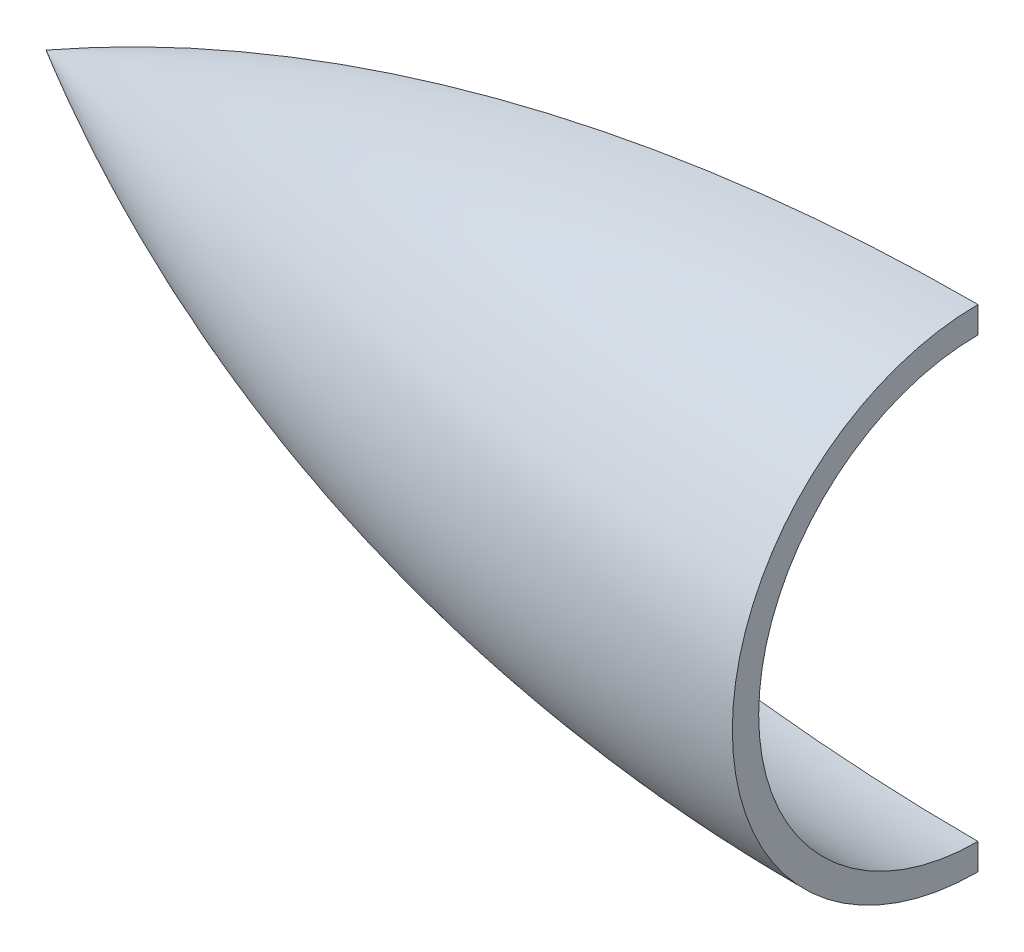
ISO-10303-21;
HEADER;
FILE_DESCRIPTION(('STEP AP214'),'2;1');
FILE_NAME('part.step','',(''),(''),'','','');
FILE_SCHEMA(('AUTOMOTIVE_DESIGN { 1 0 10303 214 1 1 1 1 }'));
ENDSEC;
DATA;
#1=APPLICATION_CONTEXT('core data for automotive mechanical design processes');
#2=APPLICATION_PROTOCOL_DEFINITION('international standard','automotive_design',2000,#1);
#3=PRODUCT_CONTEXT('',#1,'mechanical');
#4=PRODUCT('Part','Part','',(#3));
#5=PRODUCT_RELATED_PRODUCT_CATEGORY('part','',(#4));
#6=PRODUCT_DEFINITION_FORMATION('','',#4);
#7=PRODUCT_DEFINITION_CONTEXT('part definition',#1,'design');
#8=PRODUCT_DEFINITION('design','',#6,#7);
#9=PRODUCT_DEFINITION_SHAPE('','',#8);
#10=(LENGTH_UNIT() NAMED_UNIT(*) SI_UNIT(.MILLI.,.METRE.));
#11=(NAMED_UNIT(*) PLANE_ANGLE_UNIT() SI_UNIT($,.RADIAN.));
#12=(NAMED_UNIT(*) SI_UNIT($,.STERADIAN.) SOLID_ANGLE_UNIT());
#13=UNCERTAINTY_MEASURE_WITH_UNIT(LENGTH_MEASURE(1.E-05),#10,'distance_accuracy_value','');
#14=(GEOMETRIC_REPRESENTATION_CONTEXT(3) GLOBAL_UNCERTAINTY_ASSIGNED_CONTEXT((#13)) GLOBAL_UNIT_ASSIGNED_CONTEXT((#10,
#11,#12)) REPRESENTATION_CONTEXT('',''));
#15=CARTESIAN_POINT('',(0.,0.,0.));
#16=DIRECTION('',(0.,0.,1.));
#17=DIRECTION('',(1.,0.,0.));
#18=AXIS2_PLACEMENT_3D('',#15,#16,#17);
#19=CARTESIAN_POINT('',(0.,95.25,-95.25));
#20=DIRECTION('',(0.,-1.,0.));
#21=DIRECTION('',(0.,0.,1.));
#22=AXIS2_PLACEMENT_3D('',#19,#20,#21);
#23=CIRCLE('',#22,107.95);
#24=TRIMMED_CURVE('',#23,(PARAMETER_VALUE(-0.489957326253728)),
(PARAMETER_VALUE(0.489957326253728)),.T.,.PARAMETER.);
#25=CARTESIAN_POINT('',(0.,95.25,0.));
#26=DIRECTION('',(-1.,0.,0.));
#27=AXIS1_PLACEMENT('',#25,#26);
#28=SURFACE_OF_REVOLUTION('',#24,#27);
#29=CARTESIAN_POINT('',(0.,95.25,0.));
#30=DIRECTION('',(-1.,0.,0.));
#31=DIRECTION('',(0.,0.,1.));
#32=AXIS2_PLACEMENT_3D('',#29,#30,#31);
#33=CIRCLE('',#32,12.7);
#34=CARTESIAN_POINT('',(0.,82.55,0.));
#35=VERTEX_POINT('',#34);
#36=CARTESIAN_POINT('',(0.,107.95,0.));
#37=VERTEX_POINT('',#36);
#38=EDGE_CURVE('E11',#35,#37,#33,.T.);
#39=ORIENTED_EDGE('',*,*,#38,.F.);
#40=CARTESIAN_POINT('',(0.,190.5,6.65127195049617E-13));
#41=DIRECTION('',(0.,0.,1.));
#42=DIRECTION('',(1.,0.,0.));
#43=AXIS2_PLACEMENT_3D('',#40,#41,#42);
#44=CIRCLE('',#43,107.95);
#45=CARTESIAN_POINT('',(-50.8,95.25,0.));
#46=VERTEX_POINT('',#45);
#47=EDGE_CURVE('E72',#46,#35,#44,.T.);
#48=ORIENTED_EDGE('',*,*,#47,.F.);
#49=CARTESIAN_POINT('',(0.,0.,0.));
#50=DIRECTION('',(0.,0.,-1.));
#51=DIRECTION('',(1.,0.,0.));
#52=AXIS2_PLACEMENT_3D('',#49,#50,#51);
#53=CIRCLE('',#52,107.95);
#54=EDGE_CURVE('E46',#46,#37,#53,.T.);
#55=ORIENTED_EDGE('',*,*,#54,.T.);
#56=EDGE_LOOP('',(#39,#48,#55));
#57=FACE_BOUND('',#56,.T.);
#58=ADVANCED_FACE('F31',(#57),#28,.F.);
#59=CARTESIAN_POINT('',(0.,82.55,0.));
#60=DIRECTION('',(-1.,0.,0.));
#61=DIRECTION('',(0.,0.,1.));
#62=AXIS2_PLACEMENT_3D('',#59,#60,#61);
#63=PLANE('',#62);
#64=CARTESIAN_POINT('',(0.,95.25,0.));
#65=DIRECTION('',(-1.,0.,0.));
#66=DIRECTION('',(0.,0.,1.));
#67=AXIS2_PLACEMENT_3D('',#64,#65,#66);
#68=CIRCLE('',#67,14.224);
#69=CARTESIAN_POINT('',(0.,81.026,0.));
#70=VERTEX_POINT('',#69);
#71=CARTESIAN_POINT('',(0.,109.474,0.));
#72=VERTEX_POINT('',#71);
#73=EDGE_CURVE('E39',#70,#72,#68,.T.);
#74=ORIENTED_EDGE('',*,*,#73,.F.);
#75=DIRECTION('',(0.,-1.,0.));
#76=VECTOR('',#75,1.);
#77=CARTESIAN_POINT('',(0.,82.55,0.));
#78=LINE('',#77,#76);
#79=EDGE_CURVE('E70',#35,#70,#78,.T.);
#80=ORIENTED_EDGE('',*,*,#79,.F.);
#81=ORIENTED_EDGE('',*,*,#38,.T.);
#82=DIRECTION('',(0.,1.,0.));
#83=VECTOR('',#82,1.);
#84=CARTESIAN_POINT('',(0.,107.95,0.));
#85=LINE('',#84,#83);
#86=EDGE_CURVE('E68',#37,#72,#85,.T.);
#87=ORIENTED_EDGE('',*,*,#86,.T.);
#88=EDGE_LOOP('',(#74,#80,#81,#87));
#89=FACE_BOUND('',#88,.T.);
#90=ADVANCED_FACE('F33',(#89),#63,.F.);
#91=CARTESIAN_POINT('',(0.,95.25,-95.25));
#92=DIRECTION('',(0.,-1.,0.));
#93=DIRECTION('',(0.,0.,1.));
#94=AXIS2_PLACEMENT_3D('',#91,#92,#93);
#95=CIRCLE('',#94,109.474);
#96=TRIMMED_CURVE('',#95,(PARAMETER_VALUE(-0.515452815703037)),
(PARAMETER_VALUE(0.515452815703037)),.T.,.PARAMETER.);
#97=CARTESIAN_POINT('',(0.,95.25,0.));
#98=DIRECTION('',(-1.,0.,0.));
#99=AXIS1_PLACEMENT('',#97,#98);
#100=SURFACE_OF_REVOLUTION('',#96,#99);
#101=CARTESIAN_POINT('',(0.,0.,0.));
#102=DIRECTION('',(0.,0.,1.));
#103=DIRECTION('',(1.,0.,0.));
#104=AXIS2_PLACEMENT_3D('',#101,#102,#103);
#105=CIRCLE('',#104,109.474);
#106=CARTESIAN_POINT('',(-53.9628962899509,95.25,0.));
#107=VERTEX_POINT('',#106);
#108=EDGE_CURVE('E54',#72,#107,#105,.T.);
#109=ORIENTED_EDGE('',*,*,#108,.T.);
#110=CARTESIAN_POINT('',(0.,190.5,6.65127195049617E-13));
#111=DIRECTION('',(0.,0.,-1.));
#112=DIRECTION('',(1.,0.,0.));
#113=AXIS2_PLACEMENT_3D('',#110,#111,#112);
#114=CIRCLE('',#113,109.474);
#115=EDGE_CURVE('E80',#70,#107,#114,.T.);
#116=ORIENTED_EDGE('',*,*,#115,.F.);
#117=ORIENTED_EDGE('',*,*,#73,.T.);
#118=EDGE_LOOP('',(#109,#116,#117));
#119=FACE_BOUND('',#118,.T.);
#120=ADVANCED_FACE('F81',(#119),#100,.T.);
#121=CARTESIAN_POINT('',(0.,190.5,6.65127195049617E-13));
#122=DIRECTION('',(0.,0.,-1.));
#123=DIRECTION('',(1.,0.,0.));
#124=AXIS2_PLACEMENT_3D('',#121,#122,#123);
#125=PLANE('',#124);
#126=ORIENTED_EDGE('',*,*,#47,.T.);
#127=ORIENTED_EDGE('',*,*,#79,.T.);
#128=ORIENTED_EDGE('',*,*,#115,.T.);
#129=ORIENTED_EDGE('',*,*,#108,.F.);
#130=ORIENTED_EDGE('',*,*,#86,.F.);
#131=ORIENTED_EDGE('',*,*,#54,.F.);
#132=EDGE_LOOP('',(#126,#127,#128,#129,#130,#131));
#133=FACE_BOUND('',#132,.T.);
#134=ADVANCED_FACE('F74',(#133),#125,.T.);
#135=CLOSED_SHELL('',(#58,#90,#120,#134));
#136=MANIFOLD_SOLID_BREP('B2',#135);
#137=ADVANCED_BREP_SHAPE_REPRESENTATION('',(#18,#136),#14);
#138=SHAPE_DEFINITION_REPRESENTATION(#9,#137);
ENDSEC;
END-ISO-10303-21;
